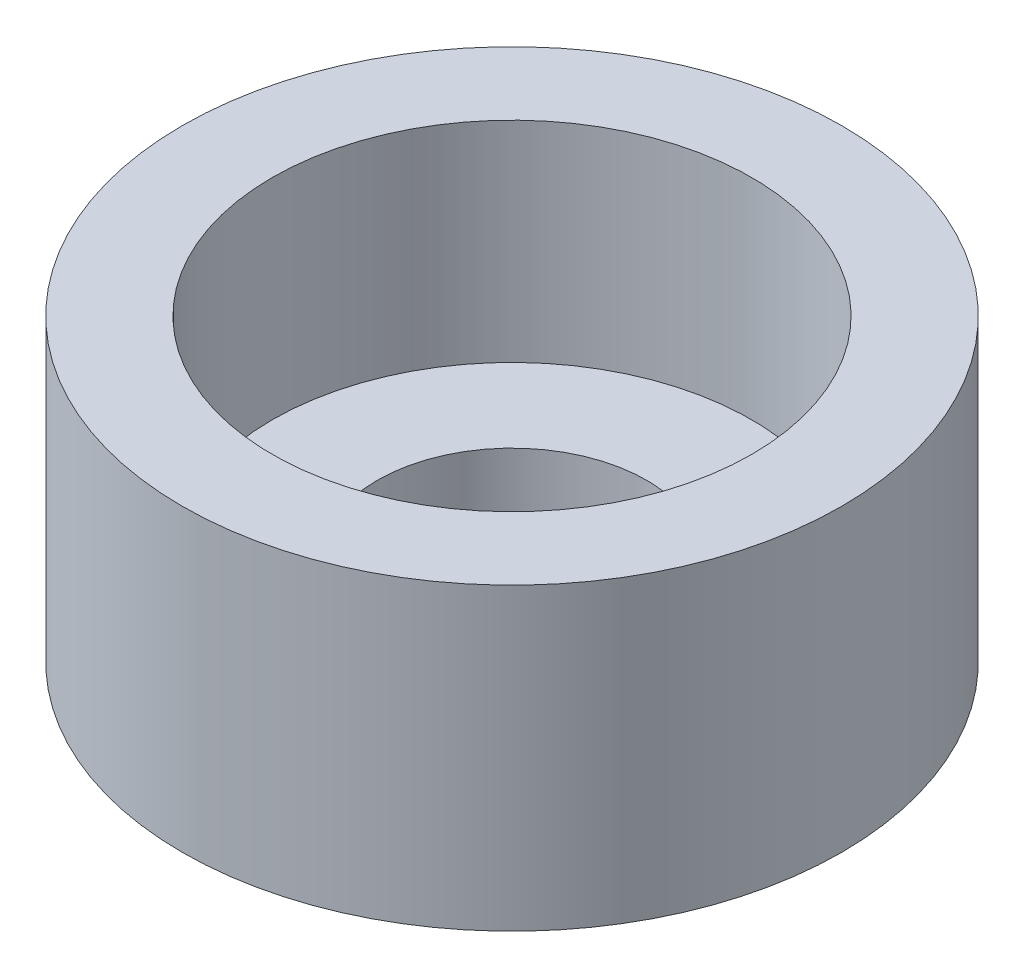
ISO-10303-21;
HEADER;
FILE_DESCRIPTION(('STEP AP214'),'2;1');
FILE_NAME('part.step','',(''),(''),'','','');
FILE_SCHEMA(('AUTOMOTIVE_DESIGN { 1 0 10303 214 1 1 1 1 }'));
ENDSEC;
DATA;
#1=APPLICATION_CONTEXT('core data for automotive mechanical design processes');
#2=APPLICATION_PROTOCOL_DEFINITION('international standard','automotive_design',2000,#1);
#3=PRODUCT_CONTEXT('',#1,'mechanical');
#4=PRODUCT('Part','Part','',(#3));
#5=PRODUCT_RELATED_PRODUCT_CATEGORY('part','',(#4));
#6=PRODUCT_DEFINITION_FORMATION('','',#4);
#7=PRODUCT_DEFINITION_CONTEXT('part definition',#1,'design');
#8=PRODUCT_DEFINITION('design','',#6,#7);
#9=PRODUCT_DEFINITION_SHAPE('','',#8);
#10=(LENGTH_UNIT() NAMED_UNIT(*) SI_UNIT(.MILLI.,.METRE.));
#11=(NAMED_UNIT(*) PLANE_ANGLE_UNIT() SI_UNIT($,.RADIAN.));
#12=(NAMED_UNIT(*) SI_UNIT($,.STERADIAN.) SOLID_ANGLE_UNIT());
#13=UNCERTAINTY_MEASURE_WITH_UNIT(LENGTH_MEASURE(1.E-05),#10,'distance_accuracy_value','');
#14=(GEOMETRIC_REPRESENTATION_CONTEXT(3) GLOBAL_UNCERTAINTY_ASSIGNED_CONTEXT((#13)) GLOBAL_UNIT_ASSIGNED_CONTEXT((#10,
#11,#12)) REPRESENTATION_CONTEXT('',''));
#15=CARTESIAN_POINT('',(0.,0.,0.));
#16=DIRECTION('',(0.,0.,1.));
#17=DIRECTION('',(1.,0.,0.));
#18=AXIS2_PLACEMENT_3D('',#15,#16,#17);
#19=CARTESIAN_POINT('',(0.,35.783215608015,0.));
#20=DIRECTION('',(0.,1.,0.));
#21=DIRECTION('',(-1.00000000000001,0.,0.));
#22=AXIS2_PLACEMENT_3D('',#19,#20,#21);
#23=CYLINDRICAL_SURFACE('',#22,11.);
#24=CARTESIAN_POINT('',(0.,0.,0.));
#25=DIRECTION('',(0.,1.,0.));
#26=DIRECTION('',(-1.00000000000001,0.,0.));
#27=AXIS2_PLACEMENT_3D('',#24,#25,#26);
#28=CIRCLE('',#27,11.);
#29=CARTESIAN_POINT('',(-11.0000000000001,0.,0.));
#30=VERTEX_POINT('',#29);
#31=EDGE_CURVE('E10',#30,#30,#28,.T.);
#32=ORIENTED_EDGE('',*,*,#31,.T.);
#33=EDGE_LOOP('',(#32));
#34=FACE_BOUND('',#33,.T.);
#35=CARTESIAN_POINT('',(0.,10.,0.));
#36=DIRECTION('',(0.,1.,0.));
#37=DIRECTION('',(-1.00000000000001,0.,0.));
#38=AXIS2_PLACEMENT_3D('',#35,#36,#37);
#39=CIRCLE('',#38,11.);
#40=CARTESIAN_POINT('',(-11.0000000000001,10.,0.));
#41=VERTEX_POINT('',#40);
#42=EDGE_CURVE('E36',#41,#41,#39,.T.);
#43=ORIENTED_EDGE('',*,*,#42,.F.);
#44=EDGE_LOOP('',(#43));
#45=FACE_BOUND('',#44,.T.);
#46=ADVANCED_FACE('F14',(#34,#45),#23,.T.);
#47=CARTESIAN_POINT('',(-4.50000000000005,0.,0.));
#48=DIRECTION('',(0.,-1.,0.));
#49=DIRECTION('',(1.00000000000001,0.,0.));
#50=AXIS2_PLACEMENT_3D('',#47,#48,#49);
#51=PLANE('',#50);
#52=CARTESIAN_POINT('',(0.,0.,0.));
#53=DIRECTION('',(0.,1.,0.));
#54=DIRECTION('',(-1.00000000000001,0.,0.));
#55=AXIS2_PLACEMENT_3D('',#52,#53,#54);
#56=CIRCLE('',#55,4.5);
#57=CARTESIAN_POINT('',(-4.50000000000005,0.,0.));
#58=VERTEX_POINT('',#57);
#59=EDGE_CURVE('E20',#58,#58,#56,.T.);
#60=ORIENTED_EDGE('',*,*,#59,.T.);
#61=EDGE_LOOP('',(#60));
#62=FACE_BOUND('',#61,.T.);
#63=ORIENTED_EDGE('',*,*,#31,.F.);
#64=EDGE_LOOP('',(#63));
#65=FACE_BOUND('',#64,.T.);
#66=ADVANCED_FACE('F44',(#62,#65),#51,.T.);
#67=CARTESIAN_POINT('',(0.,35.783215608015,0.));
#68=DIRECTION('',(0.,1.,0.));
#69=DIRECTION('',(-1.00000000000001,0.,0.));
#70=AXIS2_PLACEMENT_3D('',#67,#68,#69);
#71=CYLINDRICAL_SURFACE('',#70,4.5);
#72=CARTESIAN_POINT('',(0.,3.,0.));
#73=DIRECTION('',(0.,1.,0.));
#74=DIRECTION('',(-1.00000000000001,0.,0.));
#75=AXIS2_PLACEMENT_3D('',#72,#73,#74);
#76=CIRCLE('',#75,4.5);
#77=CARTESIAN_POINT('',(-4.50000000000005,3.,0.));
#78=VERTEX_POINT('',#77);
#79=EDGE_CURVE('E24',#78,#78,#76,.T.);
#80=ORIENTED_EDGE('',*,*,#79,.T.);
#81=EDGE_LOOP('',(#80));
#82=FACE_BOUND('',#81,.T.);
#83=ORIENTED_EDGE('',*,*,#59,.F.);
#84=EDGE_LOOP('',(#83));
#85=FACE_BOUND('',#84,.T.);
#86=ADVANCED_FACE('F49',(#82,#85),#71,.F.);
#87=CARTESIAN_POINT('',(-4.50000000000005,3.,0.));
#88=DIRECTION('',(0.,1.,0.));
#89=DIRECTION('',(-1.00000000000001,0.,0.));
#90=AXIS2_PLACEMENT_3D('',#87,#88,#89);
#91=PLANE('',#90);
#92=CARTESIAN_POINT('',(0.,3.,0.));
#93=DIRECTION('',(0.,1.,0.));
#94=DIRECTION('',(-1.00000000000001,0.,0.));
#95=AXIS2_PLACEMENT_3D('',#92,#93,#94);
#96=CIRCLE('',#95,8.);
#97=CARTESIAN_POINT('',(-8.0000000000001,3.,0.));
#98=VERTEX_POINT('',#97);
#99=EDGE_CURVE('E28',#98,#98,#96,.T.);
#100=ORIENTED_EDGE('',*,*,#99,.T.);
#101=EDGE_LOOP('',(#100));
#102=FACE_BOUND('',#101,.T.);
#103=ORIENTED_EDGE('',*,*,#79,.F.);
#104=EDGE_LOOP('',(#103));
#105=FACE_BOUND('',#104,.T.);
#106=ADVANCED_FACE('F53',(#102,#105),#91,.T.);
#107=CARTESIAN_POINT('',(0.,35.783215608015,0.));
#108=DIRECTION('',(0.,1.,0.));
#109=DIRECTION('',(-1.00000000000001,0.,0.));
#110=AXIS2_PLACEMENT_3D('',#107,#108,#109);
#111=CYLINDRICAL_SURFACE('',#110,8.);
#112=CARTESIAN_POINT('',(0.,10.,0.));
#113=DIRECTION('',(0.,1.,0.));
#114=DIRECTION('',(-1.00000000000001,0.,0.));
#115=AXIS2_PLACEMENT_3D('',#112,#113,#114);
#116=CIRCLE('',#115,8.);
#117=CARTESIAN_POINT('',(-8.0000000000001,10.,0.));
#118=VERTEX_POINT('',#117);
#119=EDGE_CURVE('E33',#118,#118,#116,.T.);
#120=ORIENTED_EDGE('',*,*,#119,.T.);
#121=EDGE_LOOP('',(#120));
#122=FACE_BOUND('',#121,.T.);
#123=ORIENTED_EDGE('',*,*,#99,.F.);
#124=EDGE_LOOP('',(#123));
#125=FACE_BOUND('',#124,.T.);
#126=ADVANCED_FACE('F60',(#122,#125),#111,.F.);
#127=CARTESIAN_POINT('',(-8.0000000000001,10.,0.));
#128=DIRECTION('',(0.,1.,0.));
#129=DIRECTION('',(-1.00000000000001,0.,0.));
#130=AXIS2_PLACEMENT_3D('',#127,#128,#129);
#131=PLANE('',#130);
#132=ORIENTED_EDGE('',*,*,#42,.T.);
#133=EDGE_LOOP('',(#132));
#134=FACE_BOUND('',#133,.T.);
#135=ORIENTED_EDGE('',*,*,#119,.F.);
#136=EDGE_LOOP('',(#135));
#137=FACE_BOUND('',#136,.T.);
#138=ADVANCED_FACE('F40',(#134,#137),#131,.T.);
#139=CLOSED_SHELL('',(#46,#66,#86,#106,#126,#138));
#140=MANIFOLD_SOLID_BREP('B1',#139);
#141=ADVANCED_BREP_SHAPE_REPRESENTATION('',(#18,#140),#14);
#142=SHAPE_DEFINITION_REPRESENTATION(#9,#141);
ENDSEC;
END-ISO-10303-21;
